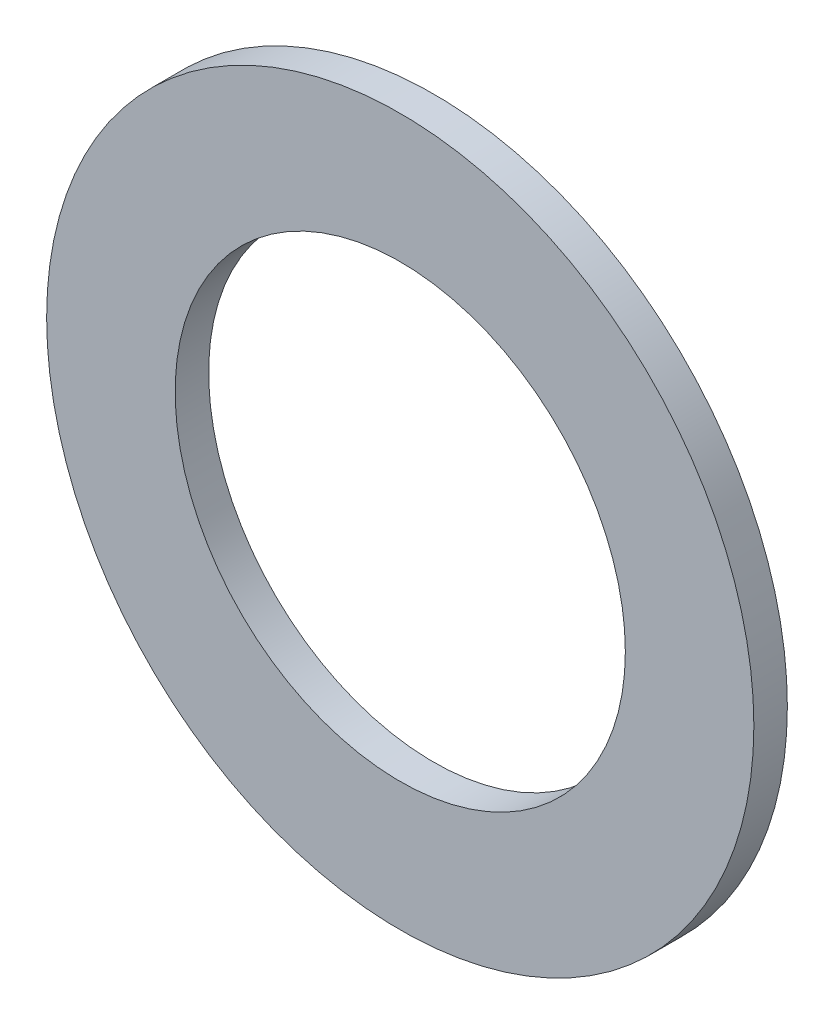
from build123d import *

# Parameters (mm, degrees)
ESQUISSE1_R          = 10.556744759
ESQUISSE1_R_2        = 6.719897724
BASE_EXTRUSION_DEPTH = 1


with BuildPart() as part:
    # Esquisse1 → Base-Extrusion (new body)
    with BuildSketch(Plane.XY):
        with Locations((94.629411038, 484.732393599)):
            Circle(ESQUISSE1_R)
        with Locations((94.629411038, 484.732393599)):
            Circle(ESQUISSE1_R_2, mode=Mode.SUBTRACT)
    extrude(amount=-BASE_EXTRUSION_DEPTH)


solid = part.part
